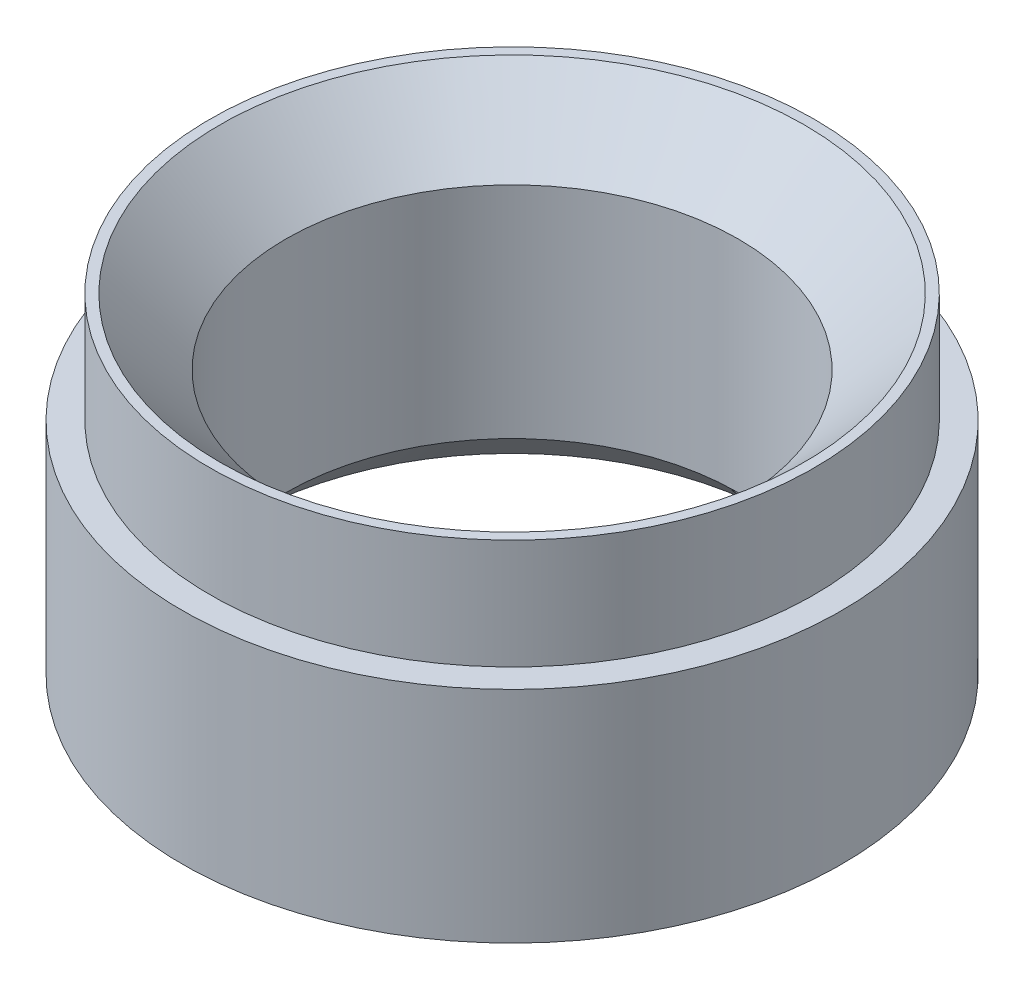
ISO-10303-21;
HEADER;
FILE_DESCRIPTION(('STEP AP214'),'2;1');
FILE_NAME('part.step','',(''),(''),'','','');
FILE_SCHEMA(('AUTOMOTIVE_DESIGN { 1 0 10303 214 1 1 1 1 }'));
ENDSEC;
DATA;
#1=APPLICATION_CONTEXT('core data for automotive mechanical design processes');
#2=APPLICATION_PROTOCOL_DEFINITION('international standard','automotive_design',2000,#1);
#3=PRODUCT_CONTEXT('',#1,'mechanical');
#4=PRODUCT('Part','Part','',(#3));
#5=PRODUCT_RELATED_PRODUCT_CATEGORY('part','',(#4));
#6=PRODUCT_DEFINITION_FORMATION('','',#4);
#7=PRODUCT_DEFINITION_CONTEXT('part definition',#1,'design');
#8=PRODUCT_DEFINITION('design','',#6,#7);
#9=PRODUCT_DEFINITION_SHAPE('','',#8);
#10=(LENGTH_UNIT() NAMED_UNIT(*) SI_UNIT(.MILLI.,.METRE.));
#11=(NAMED_UNIT(*) PLANE_ANGLE_UNIT() SI_UNIT($,.RADIAN.));
#12=(NAMED_UNIT(*) SI_UNIT($,.STERADIAN.) SOLID_ANGLE_UNIT());
#13=UNCERTAINTY_MEASURE_WITH_UNIT(LENGTH_MEASURE(1.E-05),#10,'distance_accuracy_value','');
#14=(GEOMETRIC_REPRESENTATION_CONTEXT(3) GLOBAL_UNCERTAINTY_ASSIGNED_CONTEXT((#13)) GLOBAL_UNIT_ASSIGNED_CONTEXT((#10,
#11,#12)) REPRESENTATION_CONTEXT('',''));
#15=CARTESIAN_POINT('',(0.,0.,0.));
#16=DIRECTION('',(0.,0.,1.));
#17=DIRECTION('',(1.,0.,0.));
#18=AXIS2_PLACEMENT_3D('',#15,#16,#17);
#19=CARTESIAN_POINT('',(0.,0.,0.));
#20=DIRECTION('',(0.,-1.,0.));
#21=DIRECTION('',(0.,0.,-1.));
#22=AXIS2_PLACEMENT_3D('',#19,#20,#21);
#23=CYLINDRICAL_SURFACE('',#22,6.5405);
#24=CARTESIAN_POINT('',(0.,-1.90500000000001,0.));
#25=DIRECTION('',(0.,-1.,0.));
#26=DIRECTION('',(0.,0.,-1.));
#27=AXIS2_PLACEMENT_3D('',#24,#25,#26);
#28=CIRCLE('',#27,6.5405);
#29=CARTESIAN_POINT('',(0.,-1.90500000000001,-6.54050000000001));
#30=VERTEX_POINT('',#29);
#31=EDGE_CURVE('E11',#30,#30,#28,.F.);
#32=ORIENTED_EDGE('',*,*,#31,.T.);
#33=EDGE_LOOP('',(#32));
#34=FACE_BOUND('',#33,.T.);
#35=CARTESIAN_POINT('',(0.,-8.25500000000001,0.));
#36=DIRECTION('',(0.,1.,0.));
#37=DIRECTION('',(0.,0.,1.));
#38=AXIS2_PLACEMENT_3D('',#35,#36,#37);
#39=CIRCLE('',#38,6.5405);
#40=CARTESIAN_POINT('',(0.,-8.25500000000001,6.54050000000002));
#41=VERTEX_POINT('',#40);
#42=EDGE_CURVE('E73',#41,#41,#39,.F.);
#43=ORIENTED_EDGE('',*,*,#42,.T.);
#44=EDGE_LOOP('',(#43));
#45=FACE_BOUND('',#44,.T.);
#46=ADVANCED_FACE('F30',(#34,#45),#23,.F.);
#47=CARTESIAN_POINT('',(-6.5405,-9.52500000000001,0.));
#48=DIRECTION('',(0.,1.,0.));
#49=DIRECTION('',(0.,0.,1.));
#50=AXIS2_PLACEMENT_3D('',#47,#48,#49);
#51=PLANE('',#50);
#52=CARTESIAN_POINT('',(0.,-9.52500000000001,0.));
#53=DIRECTION('',(0.,1.,0.));
#54=DIRECTION('',(0.,0.,1.));
#55=AXIS2_PLACEMENT_3D('',#52,#53,#54);
#56=CIRCLE('',#55,7.8105);
#57=CARTESIAN_POINT('',(0.877743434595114,-9.525,7.76102291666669));
#58=VERTEX_POINT('',#57);
#59=CARTESIAN_POINT('',(0.877743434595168,-9.52500000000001,-7.76102291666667));
#60=VERTEX_POINT('',#59);
#61=EDGE_CURVE('E67',#58,#60,#56,.T.);
#62=ORIENTED_EDGE('',*,*,#61,.T.);
#63=CARTESIAN_POINT('',(0.,-9.52500000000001,-7.62));
#64=DIRECTION('',(0.,-1.,0.));
#65=DIRECTION('',(0.,0.,1.));
#66=AXIS2_PLACEMENT_3D('',#63,#64,#65);
#67=CIRCLE('',#66,0.889000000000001);
#68=CARTESIAN_POINT('',(-0.87774343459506,-9.52500000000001,-7.76102291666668));
#69=VERTEX_POINT('',#68);
#70=EDGE_CURVE('E44',#69,#60,#67,.T.);
#71=ORIENTED_EDGE('',*,*,#70,.F.);
#72=CARTESIAN_POINT('',(-0.877743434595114,-9.525,7.76102291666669));
#73=VERTEX_POINT('',#72);
#74=EDGE_CURVE('E51',#69,#73,#56,.T.);
#75=ORIENTED_EDGE('',*,*,#74,.T.);
#76=CARTESIAN_POINT('',(0.,-9.52500000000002,7.62));
#77=DIRECTION('',(0.,-1.,0.));
#78=DIRECTION('',(0.,0.,-1.));
#79=AXIS2_PLACEMENT_3D('',#76,#77,#78);
#80=CIRCLE('',#79,0.889000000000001);
#81=EDGE_CURVE('E172',#58,#73,#80,.T.);
#82=ORIENTED_EDGE('',*,*,#81,.F.);
#83=EDGE_LOOP('',(#62,#71,#75,#82));
#84=FACE_BOUND('',#83,.T.);
#85=CARTESIAN_POINT('',(0.,-9.52500000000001,0.));
#86=DIRECTION('',(0.,-1.,0.));
#87=DIRECTION('',(0.,0.,-1.));
#88=AXIS2_PLACEMENT_3D('',#85,#86,#87);
#89=CIRCLE('',#88,9.525);
#90=CARTESIAN_POINT('',(0.,-9.52500000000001,-9.52500000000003));
#91=VERTEX_POINT('',#90);
#92=EDGE_CURVE('E76',#91,#91,#89,.T.);
#93=ORIENTED_EDGE('',*,*,#92,.T.);
#94=EDGE_LOOP('',(#93));
#95=FACE_BOUND('',#94,.T.);
#96=ADVANCED_FACE('F65',(#84,#95),#51,.F.);
#97=CARTESIAN_POINT('',(0.,0.,0.));
#98=DIRECTION('',(0.,-1.,0.));
#99=DIRECTION('',(0.,0.,-1.));
#100=AXIS2_PLACEMENT_3D('',#97,#98,#99);
#101=CYLINDRICAL_SURFACE('',#100,9.525);
#102=ORIENTED_EDGE('',*,*,#92,.F.);
#103=EDGE_LOOP('',(#102));
#104=FACE_BOUND('',#103,.T.);
#105=CARTESIAN_POINT('',(0.,-3.17500000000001,0.));
#106=DIRECTION('',(0.,-1.,0.));
#107=DIRECTION('',(0.,0.,-1.));
#108=AXIS2_PLACEMENT_3D('',#105,#106,#107);
#109=CIRCLE('',#108,9.525);
#110=CARTESIAN_POINT('',(0.,-3.17500000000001,-9.52500000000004));
#111=VERTEX_POINT('',#110);
#112=EDGE_CURVE('E169',#111,#111,#109,.T.);
#113=ORIENTED_EDGE('',*,*,#112,.T.);
#114=EDGE_LOOP('',(#113));
#115=FACE_BOUND('',#114,.T.);
#116=ADVANCED_FACE('F108',(#104,#115),#101,.T.);
#117=CARTESIAN_POINT('',(-9.525,-3.17500000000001,0.));
#118=DIRECTION('',(0.,-1.,0.));
#119=DIRECTION('',(0.,0.,-1.));
#120=AXIS2_PLACEMENT_3D('',#117,#118,#119);
#121=PLANE('',#120);
#122=ORIENTED_EDGE('',*,*,#112,.F.);
#123=EDGE_LOOP('',(#122));
#124=FACE_BOUND('',#123,.T.);
#125=CARTESIAN_POINT('',(0.,-3.17500000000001,0.));
#126=DIRECTION('',(0.,-1.,0.));
#127=DIRECTION('',(0.,0.,-1.));
#128=AXIS2_PLACEMENT_3D('',#125,#126,#127);
#129=CIRCLE('',#128,8.73125);
#130=CARTESIAN_POINT('',(0.,-3.17500000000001,-8.73125000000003));
#131=VERTEX_POINT('',#130);
#132=EDGE_CURVE('E165',#131,#131,#129,.T.);
#133=ORIENTED_EDGE('',*,*,#132,.T.);
#134=EDGE_LOOP('',(#133));
#135=FACE_BOUND('',#134,.T.);
#136=ADVANCED_FACE('F104',(#124,#135),#121,.F.);
#137=CARTESIAN_POINT('',(0.,0.,0.));
#138=DIRECTION('',(0.,-1.,0.));
#139=DIRECTION('',(0.,0.,-1.));
#140=AXIS2_PLACEMENT_3D('',#137,#138,#139);
#141=CYLINDRICAL_SURFACE('',#140,8.73125);
#142=ORIENTED_EDGE('',*,*,#132,.F.);
#143=EDGE_LOOP('',(#142));
#144=FACE_BOUND('',#143,.T.);
#145=CARTESIAN_POINT('',(0.,0.,0.));
#146=DIRECTION('',(0.,-1.,0.));
#147=DIRECTION('',(0.,0.,-1.));
#148=AXIS2_PLACEMENT_3D('',#145,#146,#147);
#149=CIRCLE('',#148,8.73125);
#150=CARTESIAN_POINT('',(0.,0.,-8.73125000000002));
#151=VERTEX_POINT('',#150);
#152=EDGE_CURVE('E163',#151,#151,#149,.T.);
#153=ORIENTED_EDGE('',*,*,#152,.T.);
#154=EDGE_LOOP('',(#153));
#155=FACE_BOUND('',#154,.T.);
#156=ADVANCED_FACE('F100',(#144,#155),#141,.T.);
#157=CARTESIAN_POINT('',(-6.5405,0.,0.));
#158=DIRECTION('',(0.,-1.,0.));
#159=DIRECTION('',(0.,0.,-1.));
#160=AXIS2_PLACEMENT_3D('',#157,#158,#159);
#161=PLANE('',#160);
#162=CARTESIAN_POINT('',(0.,0.,0.));
#163=DIRECTION('',(0.,-1.,0.));
#164=DIRECTION('',(0.,0.,-1.));
#165=AXIS2_PLACEMENT_3D('',#162,#163,#164);
#166=CIRCLE('',#165,8.4455);
#167=CARTESIAN_POINT('',(0.,0.,-8.44550000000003));
#168=VERTEX_POINT('',#167);
#169=EDGE_CURVE('E38',#168,#168,#166,.T.);
#170=ORIENTED_EDGE('',*,*,#169,.T.);
#171=EDGE_LOOP('',(#170));
#172=FACE_BOUND('',#171,.T.);
#173=ORIENTED_EDGE('',*,*,#152,.F.);
#174=EDGE_LOOP('',(#173));
#175=FACE_BOUND('',#174,.T.);
#176=ADVANCED_FACE('F97',(#172,#175),#161,.F.);
#177=CARTESIAN_POINT('',(0.,-8.25500000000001,0.));
#178=DIRECTION('',(0.,-1.,0.));
#179=DIRECTION('',(0.,0.,-1.));
#180=AXIS2_PLACEMENT_3D('',#177,#178,#179);
#181=CONICAL_SURFACE('',#180,6.5405,0.78539816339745);
#182=CARTESIAN_POINT('',(0.877710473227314,-9.52519999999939,-7.76122791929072));
#183=CARTESIAN_POINT('',(0.883298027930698,-9.49126237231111,-7.72643879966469));
#184=CARTESIAN_POINT('',(0.886792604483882,-9.45704935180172,-7.69159838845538));
#185=CARTESIAN_POINT('',(0.889681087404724,-9.38830307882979,-7.62205772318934));
#186=CARTESIAN_POINT('',(0.889074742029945,-9.35376980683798,-7.58735747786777));
#187=CARTESIAN_POINT('',(0.883808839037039,-9.28412631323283,-7.51785370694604));
#188=CARTESIAN_POINT('',(0.879091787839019,-9.24901486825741,-7.4830557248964));
#189=CARTESIAN_POINT('',(0.865542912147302,-9.17896394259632,-7.41411229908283));
#190=CARTESIAN_POINT('',(0.856711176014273,-9.14402445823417,-7.37996684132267));
#191=CARTESIAN_POINT('',(0.823992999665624,-9.03981565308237,-7.27884020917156));
#192=CARTESIAN_POINT('',(0.793881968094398,-8.97113382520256,-7.21314667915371));
#193=CARTESIAN_POINT('',(0.71608201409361,-8.83858633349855,-7.08808126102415));
#194=CARTESIAN_POINT('',(0.668507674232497,-8.77469247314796,-7.02867134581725));
#195=CARTESIAN_POINT('',(0.582327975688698,-8.68592463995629,-6.94710869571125));
#196=CARTESIAN_POINT('',(0.551028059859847,-8.65744764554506,-6.92112060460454));
#197=CARTESIAN_POINT('',(0.48316427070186,-8.60398610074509,-6.87259787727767));
#198=CARTESIAN_POINT('',(0.446606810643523,-8.57899736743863,-6.85005910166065));
#199=CARTESIAN_POINT('',(0.375663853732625,-8.53826058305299,-6.81348108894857));
#200=CARTESIAN_POINT('',(0.342187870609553,-8.52165895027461,-6.79864060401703));
#201=CARTESIAN_POINT('',(0.272042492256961,-8.49269984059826,-6.77282558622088));
#202=CARTESIAN_POINT('',(0.235377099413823,-8.48033713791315,-6.76184629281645));
#203=CARTESIAN_POINT('',(0.165314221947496,-8.4623318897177,-6.74588221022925));
#204=CARTESIAN_POINT('',(0.132255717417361,-8.45595785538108,-6.74024382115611));
#205=CARTESIAN_POINT('',(0.0651752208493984,-8.44748409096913,-6.7327516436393));
#206=CARTESIAN_POINT('',(0.0311538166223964,-8.44538180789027,-6.73089559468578));
#207=CARTESIAN_POINT('',(-0.0368916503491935,-8.44562867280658,-6.73111366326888));
#208=CARTESIAN_POINT('',(-0.0709156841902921,-8.44798210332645,-6.73319156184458));
#209=CARTESIAN_POINT('',(-0.137945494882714,-8.4569465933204,-6.74111848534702));
#210=CARTESIAN_POINT('',(-0.170950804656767,-8.46355957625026,-6.74696921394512));
#211=CARTESIAN_POINT('',(-0.235195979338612,-8.48055372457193,-6.76204008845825));
#212=CARTESIAN_POINT('',(-0.266433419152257,-8.49093992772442,-6.77126473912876));
#213=CARTESIAN_POINT('',(-0.326634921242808,-8.51484720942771,-6.7925628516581));
#214=CARTESIAN_POINT('',(-0.355597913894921,-8.52836975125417,-6.80463764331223));
#215=CARTESIAN_POINT('',(-0.426680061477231,-8.56627596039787,-6.83860787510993));
#216=CARTESIAN_POINT('',(-0.467016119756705,-8.59248604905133,-6.86220313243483));
#217=CARTESIAN_POINT('',(-0.541596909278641,-8.64915326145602,-6.91356198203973));
#218=CARTESIAN_POINT('',(-0.575825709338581,-8.67962113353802,-6.94133613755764));
#219=CARTESIAN_POINT('',(-0.652283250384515,-8.75746957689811,-7.01282179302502));
#220=CARTESIAN_POINT('',(-0.691405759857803,-8.80639337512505,-7.0581688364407));
#221=CARTESIAN_POINT('',(-0.758715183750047,-8.90759886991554,-7.15302930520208));
#222=CARTESIAN_POINT('',(-0.786879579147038,-8.95988722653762,-7.20255105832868));
#223=CARTESIAN_POINT('',(-0.839214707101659,-9.08061877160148,-7.31819112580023));
#224=CARTESIAN_POINT('',(-0.860237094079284,-9.14960130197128,-7.38517143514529));
#225=CARTESIAN_POINT('',(-0.88623611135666,-9.28801915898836,-7.52148880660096));
#226=CARTESIAN_POINT('',(-0.891244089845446,-9.3574533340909,-7.59082099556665));
#227=CARTESIAN_POINT('',(-0.887319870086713,-9.44276531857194,-7.67715772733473));
#228=CARTESIAN_POINT('',(-0.886077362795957,-9.45934088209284,-7.69398717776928));
#229=CARTESIAN_POINT('',(-0.882623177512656,-9.49236423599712,-7.72762339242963));
#230=CARTESIAN_POINT('',(-0.880412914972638,-9.50881217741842,-7.74443015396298));
#231=CARTESIAN_POINT('',(-0.877710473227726,-9.52519999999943,-7.76122791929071));
#232=B_SPLINE_CURVE_WITH_KNOTS('',3,(#182,#183,#184,#185,#186,#187,#188,#189,#190,#191,#192,
#193,#194,#195,#196,#197,#198,#199,#200,#201,#202,#203,#204,#205,#206,#207,#208,#209,#210,#211,
#212,#213,#214,#215,#216,#217,#218,#219,#220,#221,#222,#223,#224,#225,#226,#227,#228,#229,#230,
#231),.UNSPECIFIED.,.F.,.F.,(4,2,2,2,2,2,2,2,2,2,2,2,2,2,2,2,2,2,2,2,2,2,2,2,4),(0.,
0.146699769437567,0.293408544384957,0.442202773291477,0.590993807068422,0.888483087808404,
1.1840543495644,1.3326362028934,1.48103832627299,1.60121288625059,1.72123875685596,
1.8231957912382,1.92509187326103,2.02708594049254,2.12912609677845,2.23130299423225,
2.33352765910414,2.49335544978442,2.65359425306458,2.88433457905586,3.115546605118,
3.4093887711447,3.70265538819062,3.77360552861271,3.84445224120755),.UNSPECIFIED.);
#233=EDGE_CURVE('E57',#60,#69,#232,.T.);
#234=ORIENTED_EDGE('',*,*,#233,.F.);
#235=ORIENTED_EDGE('',*,*,#61,.F.);
#236=CARTESIAN_POINT('',(-0.877710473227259,-9.5251999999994,7.76122791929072));
#237=CARTESIAN_POINT('',(-0.883298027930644,-9.49126237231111,7.72643879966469));
#238=CARTESIAN_POINT('',(-0.886792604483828,-9.45704935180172,7.69159838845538));
#239=CARTESIAN_POINT('',(-0.889681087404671,-9.38830307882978,7.62205772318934));
#240=CARTESIAN_POINT('',(-0.889074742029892,-9.35376980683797,7.58735747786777));
#241=CARTESIAN_POINT('',(-0.883808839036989,-9.28412631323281,7.51785370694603));
#242=CARTESIAN_POINT('',(-0.87909178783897,-9.24901486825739,7.4830557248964));
#243=CARTESIAN_POINT('',(-0.865542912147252,-9.17896394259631,7.41411229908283));
#244=CARTESIAN_POINT('',(-0.85671117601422,-9.14402445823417,7.37996684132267));
#245=CARTESIAN_POINT('',(-0.823992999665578,-9.03981565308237,7.27884020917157));
#246=CARTESIAN_POINT('',(-0.793881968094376,-8.97113382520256,7.21314667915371));
#247=CARTESIAN_POINT('',(-0.716082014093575,-8.83858633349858,7.08808126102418));
#248=CARTESIAN_POINT('',(-0.668507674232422,-8.774692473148,7.02867134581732));
#249=CARTESIAN_POINT('',(-0.582327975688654,-8.6859246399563,6.94710869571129));
#250=CARTESIAN_POINT('',(-0.551028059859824,-8.65744764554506,6.92112060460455));
#251=CARTESIAN_POINT('',(-0.483164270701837,-8.60398610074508,6.87259787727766));
#252=CARTESIAN_POINT('',(-0.446606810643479,-8.57899736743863,6.85005910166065));
#253=CARTESIAN_POINT('',(-0.375663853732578,-8.53826058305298,6.81348108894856));
#254=CARTESIAN_POINT('',(-0.342187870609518,-8.52165895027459,6.79864060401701));
#255=CARTESIAN_POINT('',(-0.272042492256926,-8.49269984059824,6.77282558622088));
#256=CARTESIAN_POINT('',(-0.235377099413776,-8.48033713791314,6.76184629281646));
#257=CARTESIAN_POINT('',(-0.165314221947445,-8.46233188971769,6.74588221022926));
#258=CARTESIAN_POINT('',(-0.132255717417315,-8.45595785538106,6.74024382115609));
#259=CARTESIAN_POINT('',(-0.0651752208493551,-8.44748409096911,6.73275164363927));
#260=CARTESIAN_POINT('',(-0.0311538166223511,-8.44538180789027,6.73089559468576));
#261=CARTESIAN_POINT('',(0.0368916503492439,-8.44562867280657,6.73111366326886));
#262=CARTESIAN_POINT('',(0.0709156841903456,-8.44798210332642,6.73319156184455));
#263=CARTESIAN_POINT('',(0.137945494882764,-8.45694659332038,6.741118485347));
#264=CARTESIAN_POINT('',(0.170950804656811,-8.46355957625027,6.74696921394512));
#265=CARTESIAN_POINT('',(0.235195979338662,-8.48055372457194,6.76204008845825));
#266=CARTESIAN_POINT('',(0.266433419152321,-8.49093992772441,6.77126473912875));
#267=CARTESIAN_POINT('',(0.326634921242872,-8.51484720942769,6.79256285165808));
#268=CARTESIAN_POINT('',(0.355597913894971,-8.52836975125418,6.80463764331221));
#269=CARTESIAN_POINT('',(0.426680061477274,-8.5662759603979,6.83860787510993));
#270=CARTESIAN_POINT('',(0.46701611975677,-8.59248604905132,6.86220313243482));
#271=CARTESIAN_POINT('',(0.541596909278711,-8.64915326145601,6.91356198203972));
#272=CARTESIAN_POINT('',(0.575825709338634,-8.67962113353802,6.94133613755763));
#273=CARTESIAN_POINT('',(0.65228325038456,-8.75746957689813,7.01282179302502));
#274=CARTESIAN_POINT('',(0.691405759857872,-8.80639337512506,7.0581688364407));
#275=CARTESIAN_POINT('',(0.758715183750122,-8.90759886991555,7.15302930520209));
#276=CARTESIAN_POINT('',(0.786879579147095,-8.95988722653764,7.2025510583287));
#277=CARTESIAN_POINT('',(0.8392147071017,-9.08061877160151,7.31819112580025));
#278=CARTESIAN_POINT('',(0.860237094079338,-9.14960130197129,7.38517143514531));
#279=CARTESIAN_POINT('',(0.886236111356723,-9.28801915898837,7.52148880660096));
#280=CARTESIAN_POINT('',(0.891244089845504,-9.35745333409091,7.59082099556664));
#281=CARTESIAN_POINT('',(0.887319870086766,-9.44276531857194,7.67715772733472));
#282=CARTESIAN_POINT('',(0.886077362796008,-9.45934088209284,7.69398717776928));
#283=CARTESIAN_POINT('',(0.882623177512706,-9.49236423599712,7.72762339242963));
#284=CARTESIAN_POINT('',(0.880412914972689,-9.50881217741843,7.74443015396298));
#285=CARTESIAN_POINT('',(0.87771047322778,-9.52519999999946,7.76122791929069));
#286=B_SPLINE_CURVE_WITH_KNOTS('',3,(#236,#237,#238,#239,#240,#241,#242,#243,#244,#245,#246,
#247,#248,#249,#250,#251,#252,#253,#254,#255,#256,#257,#258,#259,#260,#261,#262,#263,#264,#265,
#266,#267,#268,#269,#270,#271,#272,#273,#274,#275,#276,#277,#278,#279,#280,#281,#282,#283,#284,
#285),.UNSPECIFIED.,.F.,.F.,(4,2,2,2,2,2,2,2,2,2,2,2,2,2,2,2,2,2,2,2,2,2,2,2,4),(0.,
0.146699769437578,0.293408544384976,0.442202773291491,0.590993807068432,0.88848308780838,
1.18405434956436,1.33263620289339,1.481038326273,1.6012128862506,1.72123875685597,
1.82319579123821,1.92509187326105,2.02708594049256,2.12912609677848,2.23130299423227,
2.33352765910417,2.49335544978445,2.65359425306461,2.88433457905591,3.11554660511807,
3.40938877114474,3.70265538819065,3.77360552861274,3.84445224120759),.UNSPECIFIED.);
#287=EDGE_CURVE('E63',#73,#58,#286,.T.);
#288=ORIENTED_EDGE('',*,*,#287,.F.);
#289=ORIENTED_EDGE('',*,*,#74,.F.);
#290=EDGE_LOOP('',(#234,#235,#288,#289));
#291=FACE_BOUND('',#290,.T.);
#292=ORIENTED_EDGE('',*,*,#42,.F.);
#293=EDGE_LOOP('',(#292));
#294=FACE_BOUND('',#293,.T.);
#295=ADVANCED_FACE('F71',(#291,#294),#181,.F.);
#296=CARTESIAN_POINT('',(0.,-4.7625,7.62000000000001));
#297=DIRECTION('',(0.,-1.,0.));
#298=DIRECTION('',(0.,0.,-1.));
#299=AXIS2_PLACEMENT_3D('',#296,#297,#298);
#300=CYLINDRICAL_SURFACE('',#299,0.889000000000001);
#301=ORIENTED_EDGE('',*,*,#287,.T.);
#302=ORIENTED_EDGE('',*,*,#81,.T.);
#303=EDGE_LOOP('',(#301,#302));
#304=FACE_BOUND('',#303,.T.);
#305=CARTESIAN_POINT('',(0.,-4.7625,7.62000000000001));
#306=DIRECTION('',(0.,-1.,0.));
#307=DIRECTION('',(0.,0.,-1.));
#308=AXIS2_PLACEMENT_3D('',#305,#306,#307);
#309=CIRCLE('',#308,0.889000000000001);
#310=CARTESIAN_POINT('',(0.,-4.7625,6.731));
#311=VERTEX_POINT('',#310);
#312=EDGE_CURVE('E166',#311,#311,#309,.T.);
#313=ORIENTED_EDGE('',*,*,#312,.F.);
#314=EDGE_LOOP('',(#313));
#315=FACE_BOUND('',#314,.T.);
#316=ADVANCED_FACE('F90',(#304,#315),#300,.F.);
#317=CARTESIAN_POINT('',(0.,-4.7625,7.62000000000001));
#318=DIRECTION('',(0.,-1.,0.));
#319=DIRECTION('',(0.,0.,-1.));
#320=AXIS2_PLACEMENT_3D('',#317,#318,#319);
#321=PLANE('',#320);
#322=ORIENTED_EDGE('',*,*,#312,.T.);
#323=EDGE_LOOP('',(#322));
#324=FACE_BOUND('',#323,.T.);
#325=ADVANCED_FACE('F95',(#324),#321,.T.);
#326=CARTESIAN_POINT('',(0.,-4.76250000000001,-7.62000000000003));
#327=DIRECTION('',(0.,-1.,0.));
#328=DIRECTION('',(0.,0.,-1.));
#329=AXIS2_PLACEMENT_3D('',#326,#327,#328);
#330=CYLINDRICAL_SURFACE('',#329,0.889000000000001);
#331=ORIENTED_EDGE('',*,*,#233,.T.);
#332=ORIENTED_EDGE('',*,*,#70,.T.);
#333=EDGE_LOOP('',(#331,#332));
#334=FACE_BOUND('',#333,.T.);
#335=CARTESIAN_POINT('',(0.,-4.76250000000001,-7.62000000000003));
#336=DIRECTION('',(0.,-1.,0.));
#337=DIRECTION('',(0.,0.,1.));
#338=AXIS2_PLACEMENT_3D('',#335,#336,#337);
#339=CIRCLE('',#338,0.889000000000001);
#340=CARTESIAN_POINT('',(0.,-4.76250000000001,-6.73100000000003));
#341=VERTEX_POINT('',#340);
#342=EDGE_CURVE('E68',#341,#341,#339,.T.);
#343=ORIENTED_EDGE('',*,*,#342,.F.);
#344=EDGE_LOOP('',(#343));
#345=FACE_BOUND('',#344,.T.);
#346=ADVANCED_FACE('F58',(#334,#345),#330,.F.);
#347=CARTESIAN_POINT('',(0.,-4.76250000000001,-7.62000000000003));
#348=DIRECTION('',(0.,-1.,0.));
#349=DIRECTION('',(0.,0.,1.));
#350=AXIS2_PLACEMENT_3D('',#347,#348,#349);
#351=PLANE('',#350);
#352=ORIENTED_EDGE('',*,*,#342,.T.);
#353=EDGE_LOOP('',(#352));
#354=FACE_BOUND('',#353,.T.);
#355=ADVANCED_FACE('F142',(#354),#351,.T.);
#356=CARTESIAN_POINT('',(0.,0.,0.));
#357=DIRECTION('',(0.,1.,0.));
#358=DIRECTION('',(0.,0.,1.));
#359=AXIS2_PLACEMENT_3D('',#356,#357,#358);
#360=CONICAL_SURFACE('',#359,8.4455,0.785398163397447);
#361=ORIENTED_EDGE('',*,*,#31,.F.);
#362=EDGE_LOOP('',(#361));
#363=FACE_BOUND('',#362,.T.);
#364=ORIENTED_EDGE('',*,*,#169,.F.);
#365=EDGE_LOOP('',(#364));
#366=FACE_BOUND('',#365,.T.);
#367=ADVANCED_FACE('F32',(#363,#366),#360,.F.);
#368=CLOSED_SHELL('',(#46,#96,#116,#136,#156,#176,#295,#316,#325,#346,#355,#367));
#369=MANIFOLD_SOLID_BREP('B2',#368);
#370=ADVANCED_BREP_SHAPE_REPRESENTATION('',(#18,#369),#14);
#371=SHAPE_DEFINITION_REPRESENTATION(#9,#370);
ENDSEC;
END-ISO-10303-21;
